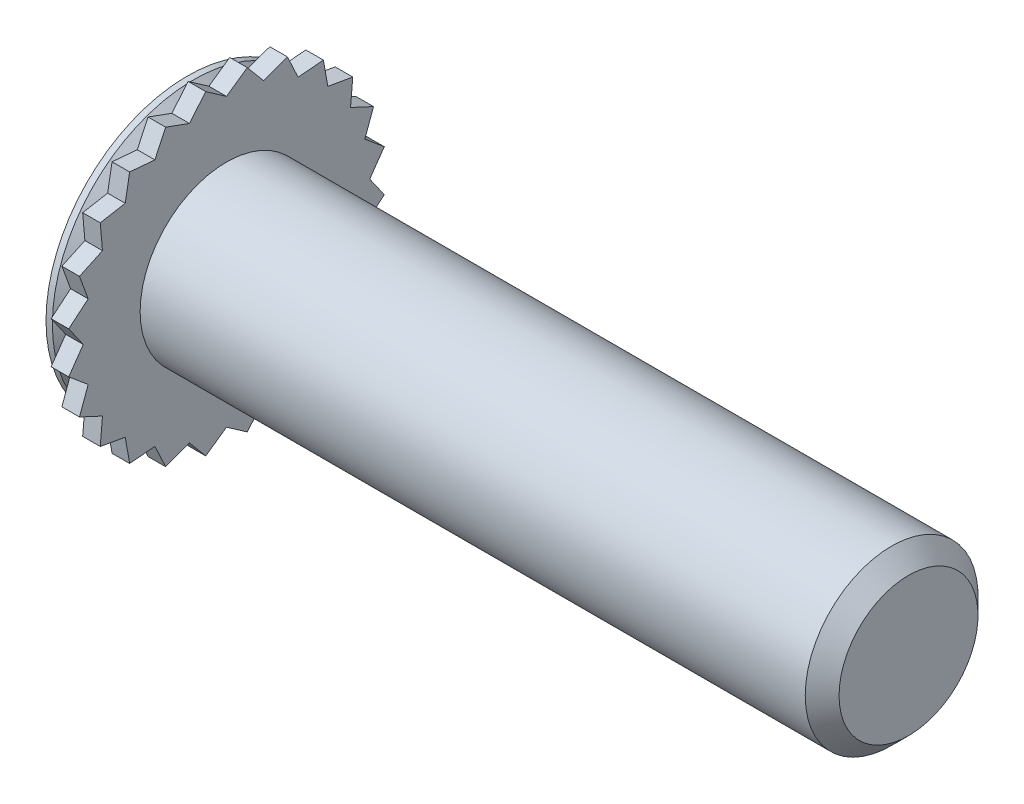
from build123d import *

# Parameters (mm, degrees)
CLINCHCUT_DEPTH    = 0.49149
CLINCHCUTPAT_COUNT = 24
CLINCHCUTPAT_ANGLE = 345


with BuildPart() as part:
    # BodySke → BaseBody (revolve)
    with BuildSketch(Plane.XY, mode=Mode.PRIVATE) as basebody_sk:
        Polygon((0, 2.2225), (0, 3.9497), (0.1778, 3.9497), (0.49149, 3.63601), (0.60071, 3.63601), (0.60071, 4.445), (1.0922, 4.445), (1.0922, 2.413), (19.66976, 2.413), (20.1422, 1.94056), (20.1422, 0), (0.5461, 0), (0.5461, 1.6764), align=None)
    revolve(basebody_sk.sketch.rotate(Axis((0, 0, 0), (1, 0, 0)), 90), axis=Axis((0, 0, 0), (1, 0, 0)))

    # CliRinCutSke → ClinchCut (cut)
    with BuildSketch(Plane(origin=(1.0922, 0, 0), x_dir=(0, 0, -1), z_dir=(1, 0, 0))):
        with BuildLine():
            Line((0.580188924, 4.406972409), (0, 4.0005))
            Line((0, 4.0005), (-0.580188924, 4.406972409))
            ThreePointArc((-0.580188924, 4.406972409), (0, 4.445), (0.580188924, 4.406972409))
        make_face()
    clinchcut = extrude(amount=-CLINCHCUT_DEPTH, mode=Mode.SUBTRACT)

    # ClinchCutPat: ClinchCut ×24 about axis
    clinchcutpat_axis = Axis((0, 0, 0), (1, 0, 0))
    for i in range(1, CLINCHCUTPAT_COUNT):
        add(clinchcut.rotate(clinchcutpat_axis, i * CLINCHCUTPAT_ANGLE / (CLINCHCUTPAT_COUNT - 1)), mode=Mode.SUBTRACT)


solid = part.part
